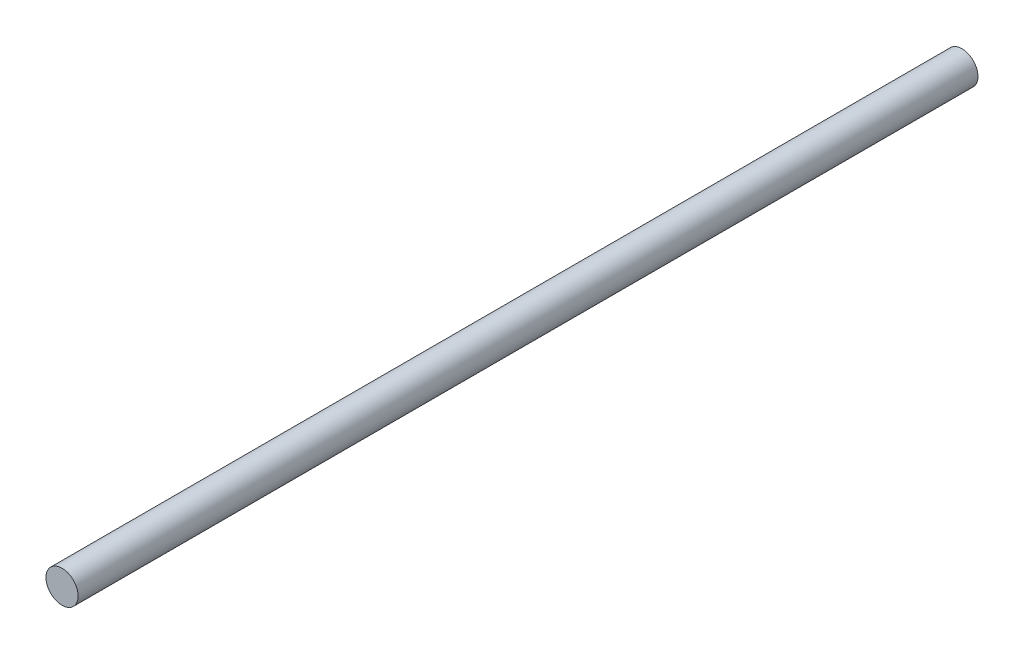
ISO-10303-21;
HEADER;
FILE_DESCRIPTION(('STEP AP214'),'2;1');
FILE_NAME('part.step','',(''),(''),'','','');
FILE_SCHEMA(('AUTOMOTIVE_DESIGN { 1 0 10303 214 1 1 1 1 }'));
ENDSEC;
DATA;
#1=APPLICATION_CONTEXT('core data for automotive mechanical design processes');
#2=APPLICATION_PROTOCOL_DEFINITION('international standard','automotive_design',2000,#1);
#3=PRODUCT_CONTEXT('',#1,'mechanical');
#4=PRODUCT('Part','Part','',(#3));
#5=PRODUCT_RELATED_PRODUCT_CATEGORY('part','',(#4));
#6=PRODUCT_DEFINITION_FORMATION('','',#4);
#7=PRODUCT_DEFINITION_CONTEXT('part definition',#1,'design');
#8=PRODUCT_DEFINITION('design','',#6,#7);
#9=PRODUCT_DEFINITION_SHAPE('','',#8);
#10=(LENGTH_UNIT() NAMED_UNIT(*) SI_UNIT(.MILLI.,.METRE.));
#11=(NAMED_UNIT(*) PLANE_ANGLE_UNIT() SI_UNIT($,.RADIAN.));
#12=(NAMED_UNIT(*) SI_UNIT($,.STERADIAN.) SOLID_ANGLE_UNIT());
#13=UNCERTAINTY_MEASURE_WITH_UNIT(LENGTH_MEASURE(1.E-05),#10,'distance_accuracy_value','');
#14=(GEOMETRIC_REPRESENTATION_CONTEXT(3) GLOBAL_UNCERTAINTY_ASSIGNED_CONTEXT((#13)) GLOBAL_UNIT_ASSIGNED_CONTEXT((#10,
#11,#12)) REPRESENTATION_CONTEXT('',''));
#15=CARTESIAN_POINT('',(0.,0.,0.));
#16=DIRECTION('',(0.,0.,1.));
#17=DIRECTION('',(1.,0.,0.));
#18=AXIS2_PLACEMENT_3D('',#15,#16,#17);
#19=CARTESIAN_POINT('',(0.,0.,222.25));
#20=DIRECTION('',(0.,0.,-1.));
#21=DIRECTION('',(-1.,0.,0.));
#22=AXIS2_PLACEMENT_3D('',#19,#20,#21);
#23=CYLINDRICAL_SURFACE('',#22,3.96875);
#24=CARTESIAN_POINT('',(0.,0.,222.25));
#25=DIRECTION('',(0.,0.,1.));
#26=DIRECTION('',(1.,0.,0.));
#27=AXIS2_PLACEMENT_3D('',#24,#25,#26);
#28=CIRCLE('',#27,3.96875);
#29=CARTESIAN_POINT('',(3.96875,0.,222.25));
#30=VERTEX_POINT('',#29);
#31=EDGE_CURVE('E10',#30,#30,#28,.T.);
#32=ORIENTED_EDGE('',*,*,#31,.F.);
#33=EDGE_LOOP('',(#32));
#34=FACE_BOUND('',#33,.T.);
#35=CARTESIAN_POINT('',(0.,0.,0.));
#36=DIRECTION('',(0.,0.,1.));
#37=DIRECTION('',(1.,0.,0.));
#38=AXIS2_PLACEMENT_3D('',#35,#36,#37);
#39=CIRCLE('',#38,3.96875);
#40=CARTESIAN_POINT('',(3.96875,0.,0.));
#41=VERTEX_POINT('',#40);
#42=EDGE_CURVE('E33',#41,#41,#39,.T.);
#43=ORIENTED_EDGE('',*,*,#42,.T.);
#44=EDGE_LOOP('',(#43));
#45=FACE_BOUND('',#44,.T.);
#46=ADVANCED_FACE('F30',(#34,#45),#23,.T.);
#47=CARTESIAN_POINT('',(0.,0.,222.25));
#48=DIRECTION('',(0.,0.,1.));
#49=DIRECTION('',(1.,0.,0.));
#50=AXIS2_PLACEMENT_3D('',#47,#48,#49);
#51=PLANE('',#50);
#52=ORIENTED_EDGE('',*,*,#31,.T.);
#53=EDGE_LOOP('',(#52));
#54=FACE_BOUND('',#53,.T.);
#55=ADVANCED_FACE('F45',(#54),#51,.T.);
#56=CARTESIAN_POINT('',(0.,0.,0.));
#57=DIRECTION('',(0.,0.,1.));
#58=DIRECTION('',(1.,0.,0.));
#59=AXIS2_PLACEMENT_3D('',#56,#57,#58);
#60=PLANE('',#59);
#61=ORIENTED_EDGE('',*,*,#42,.F.);
#62=EDGE_LOOP('',(#61));
#63=FACE_BOUND('',#62,.T.);
#64=ADVANCED_FACE('F43',(#63),#60,.F.);
#65=CLOSED_SHELL('',(#46,#55,#64));
#66=MANIFOLD_SOLID_BREP('B2',#65);
#67=ADVANCED_BREP_SHAPE_REPRESENTATION('',(#18,#66),#14);
#68=SHAPE_DEFINITION_REPRESENTATION(#9,#67);
ENDSEC;
END-ISO-10303-21;
